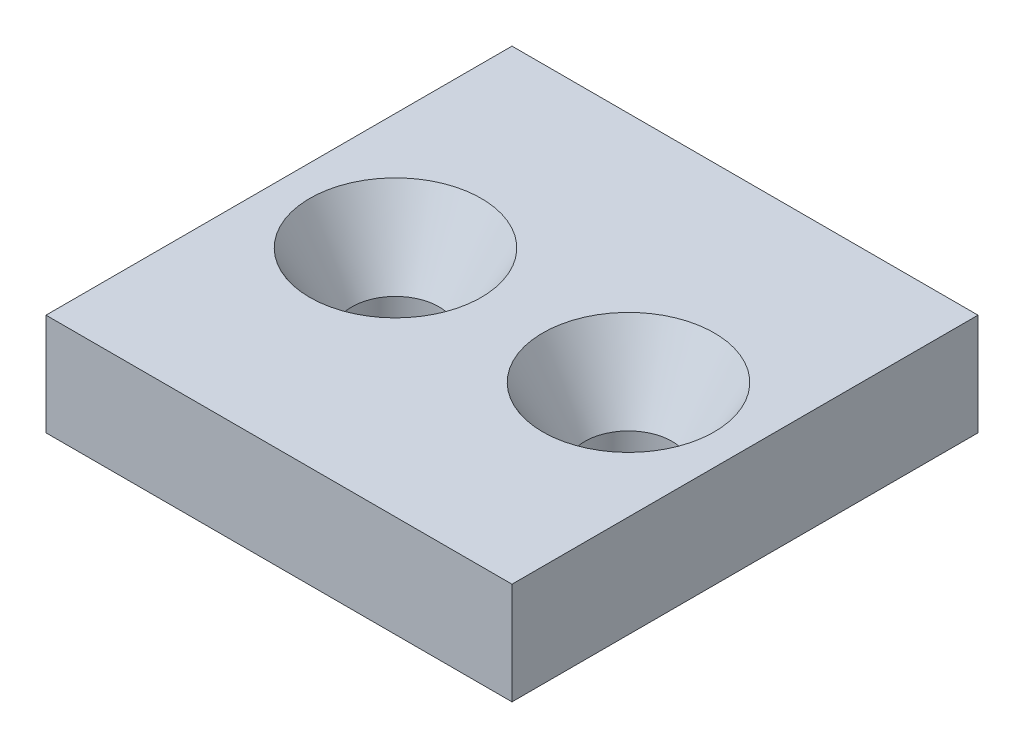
from build123d import *

# Parameters (mm, degrees)
SKETCH1_W                                    = 32
SKETCH1_H                                    = 32
BOSS_EXTRUDE1_DEPTH                          = 7
CSK_FOR_M1_6_COUNTERSUNK_FLAT_HEAD_S_2_COUNT = 2
CSK_FOR_M1_6_COUNTERSUNK_FLAT_HEAD_S_2_PITCH = 16


with BuildPart() as part:
    # Sketch1 → Boss-Extrude1 (new body)
    with BuildSketch(Plane(origin=(0, 0, 0), x_dir=(1, 0, 0), z_dir=(0, 1, 0))):
        Rectangle(SKETCH1_W, SKETCH1_H)
    extrude(amount=BOSS_EXTRUDE1_DEPTH)

    # Sketch2 → CSK for M1.6 Countersunk Flat Head Screw (revolve, cut)
    with BuildSketch(Plane(origin=(-8, 7, 0), x_dir=(0, 0, 1), z_dir=(1, 0, 0))):
        Polygon((0, 0), (0, 7), (3, 7), (3, 5.005626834), (5.89, 0), align=None)
    csk_for_m1_6_countersunk_flat_head_screw = revolve(axis=Axis((-8, 13.35, 0), (0, -1, 0)), mode=Mode.SUBTRACT)

    # CSK for M1.6 Countersunk Flat Head S 2: CSK for M1.6 Countersunk Flat Head Screw ×2
    with Locations(*[(i * CSK_FOR_M1_6_COUNTERSUNK_FLAT_HEAD_S_2_PITCH, 0, 0) for i in range(1, CSK_FOR_M1_6_COUNTERSUNK_FLAT_HEAD_S_2_COUNT)]):
        add(csk_for_m1_6_countersunk_flat_head_screw, mode=Mode.SUBTRACT)


solid = part.part
